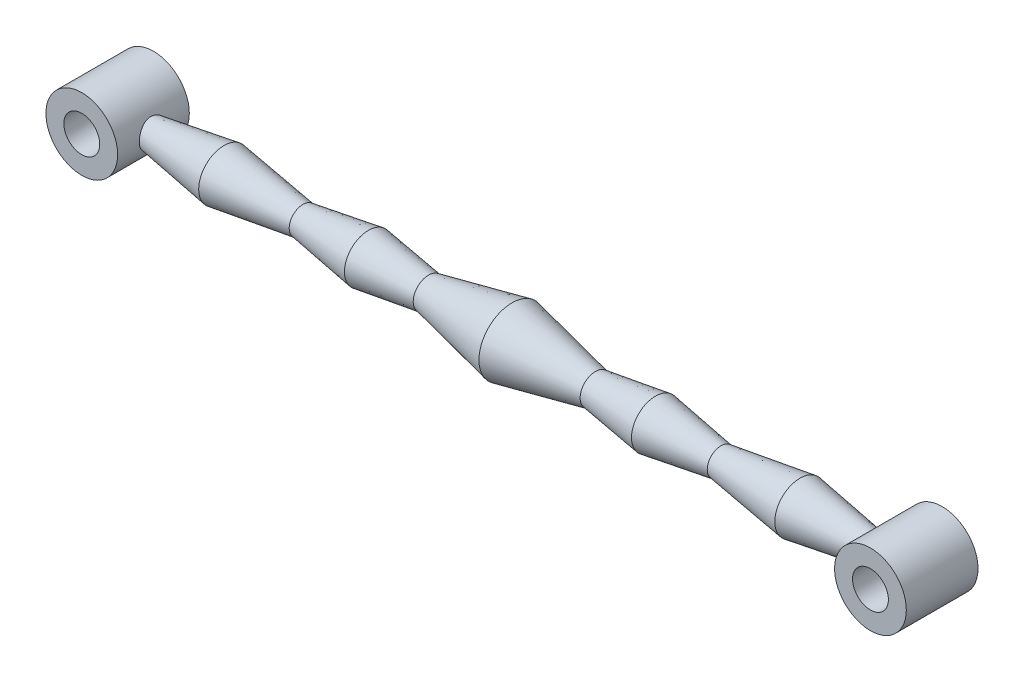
ISO-10303-21;
HEADER;
FILE_DESCRIPTION(('STEP AP214'),'2;1');
FILE_NAME('part.step','',(''),(''),'','','');
FILE_SCHEMA(('AUTOMOTIVE_DESIGN { 1 0 10303 214 1 1 1 1 }'));
ENDSEC;
DATA;
#1=APPLICATION_CONTEXT('core data for automotive mechanical design processes');
#2=APPLICATION_PROTOCOL_DEFINITION('international standard','automotive_design',2000,#1);
#3=PRODUCT_CONTEXT('',#1,'mechanical');
#4=PRODUCT('Part','Part','',(#3));
#5=PRODUCT_RELATED_PRODUCT_CATEGORY('part','',(#4));
#6=PRODUCT_DEFINITION_FORMATION('','',#4);
#7=PRODUCT_DEFINITION_CONTEXT('part definition',#1,'design');
#8=PRODUCT_DEFINITION('design','',#6,#7);
#9=PRODUCT_DEFINITION_SHAPE('','',#8);
#10=(LENGTH_UNIT() NAMED_UNIT(*) SI_UNIT(.MILLI.,.METRE.));
#11=(NAMED_UNIT(*) PLANE_ANGLE_UNIT() SI_UNIT($,.RADIAN.));
#12=(NAMED_UNIT(*) SI_UNIT($,.STERADIAN.) SOLID_ANGLE_UNIT());
#13=UNCERTAINTY_MEASURE_WITH_UNIT(LENGTH_MEASURE(1.E-05),#10,'distance_accuracy_value','');
#14=(GEOMETRIC_REPRESENTATION_CONTEXT(3) GLOBAL_UNCERTAINTY_ASSIGNED_CONTEXT((#13)) GLOBAL_UNIT_ASSIGNED_CONTEXT((#10,
#11,#12)) REPRESENTATION_CONTEXT('',''));
#15=CARTESIAN_POINT('',(0.,0.,0.));
#16=DIRECTION('',(0.,0.,1.));
#17=DIRECTION('',(1.,0.,0.));
#18=AXIS2_PLACEMENT_3D('',#15,#16,#17);
#19=CARTESIAN_POINT('',(-69.85,0.,6.35));
#20=DIRECTION('',(0.,0.,-1.));
#21=DIRECTION('',(-1.,0.,0.));
#22=AXIS2_PLACEMENT_3D('',#19,#20,#21);
#23=CYLINDRICAL_SURFACE('',#22,6.35);
#24=CARTESIAN_POINT('',(-69.85,0.,-6.35));
#25=DIRECTION('',(0.,0.,1.));
#26=DIRECTION('',(1.,0.,0.));
#27=AXIS2_PLACEMENT_3D('',#24,#25,#26);
#28=CIRCLE('',#27,6.35);
#29=CARTESIAN_POINT('',(-63.5,0.,-6.35));
#30=VERTEX_POINT('',#29);
#31=EDGE_CURVE('E54',#30,#30,#28,.T.);
#32=ORIENTED_EDGE('',*,*,#31,.T.);
#33=EDGE_LOOP('',(#32));
#34=FACE_BOUND('',#33,.T.);
#35=CARTESIAN_POINT('',(-69.85,0.,6.35));
#36=DIRECTION('',(0.,0.,1.));
#37=DIRECTION('',(1.,0.,0.));
#38=AXIS2_PLACEMENT_3D('',#35,#36,#37);
#39=CIRCLE('',#38,6.35);
#40=CARTESIAN_POINT('',(-63.5,0.,6.35));
#41=VERTEX_POINT('',#40);
#42=EDGE_CURVE('E50',#41,#41,#39,.T.);
#43=ORIENTED_EDGE('',*,*,#42,.F.);
#44=EDGE_LOOP('',(#43));
#45=FACE_BOUND('',#44,.T.);
#46=CARTESIAN_POINT('',(-63.8505130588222,-2.08054234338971,-1.30673742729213));
#47=CARTESIAN_POINT('',(-63.8255339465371,-2.00850741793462,-1.42879725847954));
#48=CARTESIAN_POINT('',(-63.7984993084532,-1.92638093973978,-1.54445966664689));
#49=CARTESIAN_POINT('',(-63.7434068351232,-1.74387161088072,-1.76007804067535));
#50=CARTESIAN_POINT('',(-63.7153490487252,-1.64348963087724,-1.86003475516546));
#51=CARTESIAN_POINT('',(-63.6612758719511,-1.42643327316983,-2.04162915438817));
#52=CARTESIAN_POINT('',(-63.6352648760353,-1.30972525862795,-2.12322808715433));
#53=CARTESIAN_POINT('',(-63.5883498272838,-1.06299680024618,-2.26498602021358));
#54=CARTESIAN_POINT('',(-63.5674435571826,-0.932982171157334,-2.32515433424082));
#55=CARTESIAN_POINT('',(-63.5341290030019,-0.670037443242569,-2.41909751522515));
#56=CARTESIAN_POINT('',(-63.5213515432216,-0.537569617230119,-2.45403063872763));
#57=CARTESIAN_POINT('',(-63.504228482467,-0.268084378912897,-2.50055972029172));
#58=CARTESIAN_POINT('',(-63.49987832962,-0.131069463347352,-2.51216827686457));
#59=CARTESIAN_POINT('',(-63.5001178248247,0.132601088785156,-2.51151940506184));
#60=CARTESIAN_POINT('',(-63.5040633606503,0.259265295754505,-2.50098154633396));
#61=CARTESIAN_POINT('',(-63.519186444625,0.508852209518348,-2.45993653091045));
#62=CARTESIAN_POINT('',(-63.5303638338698,0.63177499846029,-2.42942981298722));
#63=CARTESIAN_POINT('',(-63.5587488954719,0.870064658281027,-2.34985868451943));
#64=CARTESIAN_POINT('',(-63.575929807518,0.985462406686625,-2.3008765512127));
#65=CARTESIAN_POINT('',(-63.6146970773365,1.20670188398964,-2.18602532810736));
#66=CARTESIAN_POINT('',(-63.6362846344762,1.31254099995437,-2.12015163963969));
#67=CARTESIAN_POINT('',(-63.6834855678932,1.51941231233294,-1.9683842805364));
#68=CARTESIAN_POINT('',(-63.7092727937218,1.61962973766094,-1.8814347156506));
#69=CARTESIAN_POINT('',(-63.761142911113,1.80488015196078,-1.69268283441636));
#70=CARTESIAN_POINT('',(-63.7872259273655,1.88990646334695,-1.59087402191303));
#71=CARTESIAN_POINT('',(-63.8387903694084,2.0482337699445,-1.36746060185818));
#72=CARTESIAN_POINT('',(-63.8641136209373,2.12036308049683,-1.24498552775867));
#73=CARTESIAN_POINT('',(-63.9091704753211,2.2435168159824,-0.988889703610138));
#74=CARTESIAN_POINT('',(-63.9289047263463,2.29454368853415,-0.85527024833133));
#75=CARTESIAN_POINT('',(-63.9601559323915,2.37361565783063,-0.581479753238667));
#76=CARTESIAN_POINT('',(-63.9717300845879,2.40182092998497,-0.441361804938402));
#77=CARTESIAN_POINT('',(-63.9853043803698,2.4347853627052,-0.157960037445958));
#78=CARTESIAN_POINT('',(-63.9873080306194,2.439553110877,-0.0146773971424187));
#79=CARTESIAN_POINT('',(-63.981615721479,2.42581963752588,0.2636177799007));
#80=CARTESIAN_POINT('',(-63.9743819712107,2.40842732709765,0.398696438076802));
#81=CARTESIAN_POINT('',(-63.9519190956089,2.35287642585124,0.663816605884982));
#82=CARTESIAN_POINT('',(-63.9366889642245,2.31471522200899,0.793857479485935));
#83=CARTESIAN_POINT('',(-63.8998934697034,2.21842094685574,1.04654922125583));
#84=CARTESIAN_POINT('',(-63.8782782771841,2.16013015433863,1.16913245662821));
#85=CARTESIAN_POINT('',(-63.8311637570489,2.02514398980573,1.4029073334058));
#86=CARTESIAN_POINT('',(-63.8056631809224,1.94844269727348,1.51409529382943));
#87=CARTESIAN_POINT('',(-63.7521414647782,1.77407121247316,1.72766927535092));
#88=CARTESIAN_POINT('',(-63.7240580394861,1.67555180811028,1.82934836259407));
#89=CARTESIAN_POINT('',(-63.6696651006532,1.46221010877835,2.01450931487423));
#90=CARTESIAN_POINT('',(-63.6433556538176,1.34738720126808,2.09799049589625));
#91=CARTESIAN_POINT('',(-63.5956835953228,1.10505206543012,2.24339734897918));
#92=CARTESIAN_POINT('',(-63.5742849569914,0.977642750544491,2.30548179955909));
#93=CARTESIAN_POINT('',(-63.5387452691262,0.712976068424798,2.40635044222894));
#94=CARTESIAN_POINT('',(-63.5245993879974,0.575725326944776,2.44515014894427));
#95=CARTESIAN_POINT('',(-63.5060848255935,0.306629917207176,2.49555584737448));
#96=CARTESIAN_POINT('',(-63.5010493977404,0.175178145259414,2.50901949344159));
#97=CARTESIAN_POINT('',(-63.4992486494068,-0.0881705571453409,2.51385737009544));
#98=CARTESIAN_POINT('',(-63.5024808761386,-0.220067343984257,2.50523815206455));
#99=CARTESIAN_POINT('',(-63.5164732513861,-0.473557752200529,2.46732690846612));
#100=CARTESIAN_POINT('',(-63.5268448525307,-0.595335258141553,2.43910123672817));
#101=CARTESIAN_POINT('',(-63.5536606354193,-0.832375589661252,2.36426093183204));
#102=CARTESIAN_POINT('',(-63.5701055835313,-0.947637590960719,2.31764397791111));
#103=CARTESIAN_POINT('',(-63.6081545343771,-1.17275044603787,2.20576379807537));
#104=CARTESIAN_POINT('',(-63.6299137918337,-1.28228781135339,2.13992486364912));
#105=CARTESIAN_POINT('',(-63.6762190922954,-1.48936475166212,1.99229414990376));
#106=CARTESIAN_POINT('',(-63.7007662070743,-1.58689968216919,1.91049622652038));
#107=CARTESIAN_POINT('',(-63.7523792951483,-1.77533331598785,1.7259706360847));
#108=CARTESIAN_POINT('',(-63.7794913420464,-1.86510363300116,1.62210169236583));
#109=CARTESIAN_POINT('',(-63.8315184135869,-2.02672304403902,1.40072605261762));
#110=CARTESIAN_POINT('',(-63.8564327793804,-2.09856677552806,1.28321529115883));
#111=CARTESIAN_POINT('',(-63.902190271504,-2.22503412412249,1.03253444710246));
#112=CARTESIAN_POINT('',(-63.9228370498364,-2.27887811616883,0.898932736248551));
#113=CARTESIAN_POINT('',(-63.9561213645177,-2.36364014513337,0.623717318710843));
#114=CARTESIAN_POINT('',(-63.9687623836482,-2.39456815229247,0.482107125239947));
#115=CARTESIAN_POINT('',(-63.9840004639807,-2.43165392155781,0.200598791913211));
#116=CARTESIAN_POINT('',(-63.9869586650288,-2.43870267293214,0.0608378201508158));
#117=CARTESIAN_POINT('',(-63.9834562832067,-2.43026379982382,-0.217886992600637));
#118=CARTESIAN_POINT('',(-63.9769949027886,-2.41477426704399,-0.356850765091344));
#119=CARTESIAN_POINT('',(-63.9549262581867,-2.36040342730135,-0.637172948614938));
#120=CARTESIAN_POINT('',(-63.9388461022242,-2.32030964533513,-0.778258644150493));
#121=CARTESIAN_POINT('',(-63.8993988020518,-2.21717490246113,-1.05070338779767));
#122=CARTESIAN_POINT('',(-63.8760282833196,-2.15412331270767,-1.18205789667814));
#123=CARTESIAN_POINT('',(-63.8505130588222,-2.08054234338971,-1.30673742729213));
#124=B_SPLINE_CURVE_WITH_KNOTS('',3,(#46,#47,#48,#49,#50,#51,#52,#53,#54,#55,#56,#57,#58,#59,
#60,#61,#62,#63,#64,#65,#66,#67,#68,#69,#70,#71,#72,#73,#74,#75,#76,#77,#78,#79,#80,#81,#82,#83,
#84,#85,#86,#87,#88,#89,#90,#91,#92,#93,#94,#95,#96,#97,#98,#99,#100,#101,#102,#103,#104,#105,
#106,#107,#108,#109,#110,#111,#112,#113,#114,#115,#116,#117,#118,#119,#120,#121,#122,#123),
.UNSPECIFIED.,.T.,.F.,(4,2,2,2,2,2,2,2,2,2,2,2,2,2,2,2,2,2,2,2,2,2,2,2,2,2,2,2,2,2,2,2,2,2,2,2,
2,2,4),(0.,0.431223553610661,0.862426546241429,1.29453141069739,1.72644825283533,
2.13700194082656,2.54733381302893,2.92698501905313,3.30662788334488,3.68459965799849,
4.06267444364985,4.46642877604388,4.87036015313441,5.30143184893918,5.7324535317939,
6.16042315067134,6.58823594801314,6.99545773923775,7.40273077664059,7.81327017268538,
8.22394176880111,8.65491671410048,9.08590785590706,9.51362817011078,9.94106317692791,
10.3357108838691,10.730241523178,11.1048411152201,11.4794879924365,11.8667670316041,
12.2541954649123,12.6721499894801,13.0902293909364,13.5245912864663,13.9587640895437,
14.3765471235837,14.7943655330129,15.2346400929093,15.6751187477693),.UNSPECIFIED.);
#125=CARTESIAN_POINT('',(-63.8505130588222,-2.08054234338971,-1.30673742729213));
#126=VERTEX_POINT('',#125);
#127=EDGE_CURVE('E46',#126,#126,#124,.T.);
#128=ORIENTED_EDGE('',*,*,#127,.F.);
#129=EDGE_LOOP('',(#128));
#130=FACE_BOUND('',#129,.T.);
#131=ADVANCED_FACE('F35',(#34,#45,#130),#23,.T.);
#132=CARTESIAN_POINT('',(0.,-119.091685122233,6.35));
#133=DIRECTION('',(0.,0.,1.));
#134=DIRECTION('',(1.,0.,0.));
#135=AXIS2_PLACEMENT_3D('',#132,#133,#134);
#136=PLANE('',#135);
#137=CARTESIAN_POINT('',(-69.85,0.,6.35));
#138=DIRECTION('',(0.,0.,1.));
#139=DIRECTION('',(1.,0.,0.));
#140=AXIS2_PLACEMENT_3D('',#137,#138,#139);
#141=CIRCLE('',#140,3.175);
#142=CARTESIAN_POINT('',(-66.675,0.,6.35));
#143=VERTEX_POINT('',#142);
#144=EDGE_CURVE('E129',#143,#143,#141,.T.);
#145=ORIENTED_EDGE('',*,*,#144,.F.);
#146=EDGE_LOOP('',(#145));
#147=FACE_BOUND('',#146,.T.);
#148=ORIENTED_EDGE('',*,*,#42,.T.);
#149=EDGE_LOOP('',(#148));
#150=FACE_BOUND('',#149,.T.);
#151=ADVANCED_FACE('F109',(#147,#150),#136,.T.);
#152=CARTESIAN_POINT('',(0.,-119.091685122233,-6.35));
#153=DIRECTION('',(0.,0.,1.));
#154=DIRECTION('',(1.,0.,0.));
#155=AXIS2_PLACEMENT_3D('',#152,#153,#154);
#156=PLANE('',#155);
#157=CARTESIAN_POINT('',(-69.85,0.,-6.35));
#158=DIRECTION('',(0.,0.,1.));
#159=DIRECTION('',(1.,0.,0.));
#160=AXIS2_PLACEMENT_3D('',#157,#158,#159);
#161=CIRCLE('',#160,3.175);
#162=CARTESIAN_POINT('',(-66.675,0.,-6.35));
#163=VERTEX_POINT('',#162);
#164=EDGE_CURVE('E128',#163,#163,#161,.T.);
#165=ORIENTED_EDGE('',*,*,#164,.T.);
#166=EDGE_LOOP('',(#165));
#167=FACE_BOUND('',#166,.T.);
#168=ORIENTED_EDGE('',*,*,#31,.F.);
#169=EDGE_LOOP('',(#168));
#170=FACE_BOUND('',#169,.T.);
#171=ADVANCED_FACE('F107',(#167,#170),#156,.F.);
#172=CARTESIAN_POINT('',(-69.85,0.,-6.35));
#173=DIRECTION('',(0.,0.,1.));
#174=DIRECTION('',(1.,0.,0.));
#175=AXIS2_PLACEMENT_3D('',#172,#173,#174);
#176=CYLINDRICAL_SURFACE('',#175,3.175);
#177=ORIENTED_EDGE('',*,*,#164,.F.);
#178=EDGE_LOOP('',(#177));
#179=FACE_BOUND('',#178,.T.);
#180=ORIENTED_EDGE('',*,*,#144,.T.);
#181=EDGE_LOOP('',(#180));
#182=FACE_BOUND('',#181,.T.);
#183=ADVANCED_FACE('F65',(#179,#182),#176,.F.);
#184=CARTESIAN_POINT('',(-51.0228405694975,0.,0.));
#185=DIRECTION('',(1.,0.,0.));
#186=DIRECTION('',(0.,0.,-1.));
#187=AXIS2_PLACEMENT_3D('',#184,#185,#186);
#188=CONICAL_SURFACE('',#187,4.46848127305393,0.155551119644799);
#189=CARTESIAN_POINT('',(-51.0228405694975,0.,0.));
#190=DIRECTION('',(-1.,0.,0.));
#191=DIRECTION('',(0.,0.,1.));
#192=AXIS2_PLACEMENT_3D('',#189,#190,#191);
#193=CIRCLE('',#192,4.46848127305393);
#194=CARTESIAN_POINT('',(-51.0228405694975,0.,4.46848127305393));
#195=VERTEX_POINT('',#194);
#196=EDGE_CURVE('E159',#195,#195,#193,.T.);
#197=ORIENTED_EDGE('',*,*,#196,.T.);
#198=EDGE_LOOP('',(#197));
#199=FACE_BOUND('',#198,.T.);
#200=ORIENTED_EDGE('',*,*,#127,.T.);
#201=EDGE_LOOP('',(#200));
#202=FACE_BOUND('',#201,.T.);
#203=ADVANCED_FACE('F60',(#199,#202),#188,.T.);
#204=CARTESIAN_POINT('',(63.985701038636,0.,0.));
#205=DIRECTION('',(-1.,0.,0.));
#206=DIRECTION('',(0.,0.,1.));
#207=AXIS2_PLACEMENT_3D('',#204,#205,#206);
#208=CONICAL_SURFACE('',#207,2.43567191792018,0.155551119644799);
#209=CARTESIAN_POINT('',(51.0228405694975,0.,0.));
#210=DIRECTION('',(-1.,0.,0.));
#211=DIRECTION('',(0.,0.,1.));
#212=AXIS2_PLACEMENT_3D('',#209,#210,#211);
#213=CIRCLE('',#212,4.46848127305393);
#214=CARTESIAN_POINT('',(51.0228405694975,0.,4.46848127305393));
#215=VERTEX_POINT('',#214);
#216=EDGE_CURVE('E133',#215,#215,#213,.T.);
#217=ORIENTED_EDGE('',*,*,#216,.F.);
#218=EDGE_LOOP('',(#217));
#219=FACE_BOUND('',#218,.T.);
#220=CARTESIAN_POINT('',(63.8505130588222,-2.08054234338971,-1.30673742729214));
#221=CARTESIAN_POINT('',(63.8747198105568,-2.1503478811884,-1.18844377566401));
#222=CARTESIAN_POINT('',(63.8970303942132,-2.21076835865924,-1.06396940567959));
#223=CARTESIAN_POINT('',(63.935237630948,-2.31106068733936,-0.805817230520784));
#224=CARTESIAN_POINT('',(63.9511195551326,-2.35088540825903,-0.672119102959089));
#225=CARTESIAN_POINT('',(63.9744361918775,-2.40857491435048,-0.39915359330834));
#226=CARTESIAN_POINT('',(63.981862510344,-2.42641787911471,-0.259880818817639));
#227=CARTESIAN_POINT('',(63.9872328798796,-2.43936849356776,0.0198014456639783));
#228=CARTESIAN_POINT('',(63.9851840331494,-2.43449317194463,0.160210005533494));
#229=CARTESIAN_POINT('',(63.9721311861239,-2.40279489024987,0.433240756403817));
#230=CARTESIAN_POINT('',(63.9614323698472,-2.37671971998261,0.565965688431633));
#231=CARTESIAN_POINT('',(63.9327756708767,-2.30444212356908,0.82500532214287));
#232=CARTESIAN_POINT('',(63.9148155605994,-2.25823352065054,0.951318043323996));
#233=CARTESIAN_POINT('',(63.8732075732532,-2.14572018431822,1.19721417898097));
#234=CARTESIAN_POINT('',(63.8494387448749,-2.07897903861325,1.31657694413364));
#235=CARTESIAN_POINT('',(63.7990546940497,-1.92741455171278,1.54256879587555));
#236=CARTESIAN_POINT('',(63.7724385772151,-1.84258552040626,1.64919385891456));
#237=CARTESIAN_POINT('',(63.7179304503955,-1.65240076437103,1.85162392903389));
#238=CARTESIAN_POINT('',(63.6900351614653,-1.54629038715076,1.94672178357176));
#239=CARTESIAN_POINT('',(63.6373234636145,-1.31862591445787,2.1173197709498));
#240=CARTESIAN_POINT('',(63.6125066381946,-1.19707391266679,2.19282255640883));
#241=CARTESIAN_POINT('',(63.5694309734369,-0.944917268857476,2.31975673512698));
#242=CARTESIAN_POINT('',(63.551018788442,-0.814629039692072,2.37176146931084));
#243=CARTESIAN_POINT('',(63.5220941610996,-0.546151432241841,2.45219362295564));
#244=CARTESIAN_POINT('',(63.5115764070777,-0.407967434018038,2.48063689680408));
#245=CARTESIAN_POINT('',(63.5002283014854,-0.13959261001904,2.51126040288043));
#246=CARTESIAN_POINT('',(63.4986891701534,-0.00964865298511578,2.51536262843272));
#247=CARTESIAN_POINT('',(63.5035663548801,0.248992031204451,2.50225562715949));
#248=CARTESIAN_POINT('',(63.509981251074,0.377688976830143,2.48505020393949));
#249=CARTESIAN_POINT('',(63.5297130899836,0.625644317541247,2.43106300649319));
#250=CARTESIAN_POINT('',(63.5427851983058,0.745075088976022,2.39497448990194));
#251=CARTESIAN_POINT('',(63.5744078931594,0.976252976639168,2.30503074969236));
#252=CARTESIAN_POINT('',(63.5929594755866,1.08799869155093,2.25117229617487));
#253=CARTESIAN_POINT('',(63.63484155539,1.30663736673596,2.12437772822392));
#254=CARTESIAN_POINT('',(63.6583610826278,1.4130274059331,2.05063889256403));
#255=CARTESIAN_POINT('',(63.7073238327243,1.61264134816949,1.88760612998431));
#256=CARTESIAN_POINT('',(63.7327678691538,1.70585963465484,1.79830560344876));
#257=CARTESIAN_POINT('',(63.7851802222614,1.88407919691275,1.59879394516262));
#258=CARTESIAN_POINT('',(63.8121132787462,1.96787844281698,1.48749695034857));
#259=CARTESIAN_POINT('',(63.862517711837,2.11629836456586,1.25204165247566));
#260=CARTESIAN_POINT('',(63.885988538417,2.18091599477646,1.12788131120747));
#261=CARTESIAN_POINT('',(63.927177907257,2.29045858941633,0.866907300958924));
#262=CARTESIAN_POINT('',(63.9447581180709,2.33491764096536,0.729874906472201));
#263=CARTESIAN_POINT('',(63.9710968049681,2.40047302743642,0.449535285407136));
#264=CARTESIAN_POINT('',(63.9798591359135,2.42157957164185,0.306230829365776));
#265=CARTESIAN_POINT('',(63.9871684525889,2.43921862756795,0.0244634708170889));
#266=CARTESIAN_POINT('',(63.9861645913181,2.43683156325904,-0.113920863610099));
#267=CARTESIAN_POINT('',(63.9751511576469,2.41015637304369,-0.38818609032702));
#268=CARTESIAN_POINT('',(63.9651417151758,2.38586856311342,-0.524067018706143));
#269=CARTESIAN_POINT('',(63.9376442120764,2.31686907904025,-0.787117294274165));
#270=CARTESIAN_POINT('',(63.9202910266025,2.27252479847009,-0.91439795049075));
#271=CARTESIAN_POINT('',(63.8801286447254,2.16481539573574,-1.15971716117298));
#272=CARTESIAN_POINT('',(63.8573179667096,2.10144510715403,-1.27775319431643));
#273=CARTESIAN_POINT('',(63.8075572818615,1.95389494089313,-1.50700456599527));
#274=CARTESIAN_POINT('',(63.7804660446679,1.86889858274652,-1.61766422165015));
#275=CARTESIAN_POINT('',(63.7259370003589,1.68162156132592,-1.82320101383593));
#276=CARTESIAN_POINT('',(63.698499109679,1.5793366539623,-1.91807426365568));
#277=CARTESIAN_POINT('',(63.6457033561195,1.35737442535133,-2.09112193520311));
#278=CARTESIAN_POINT('',(63.620400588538,1.23737975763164,-2.16890823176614));
#279=CARTESIAN_POINT('',(63.5755010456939,0.98467427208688,-2.30234303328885));
#280=CARTESIAN_POINT('',(63.5559013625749,0.851969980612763,-2.35800282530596));
#281=CARTESIAN_POINT('',(63.5257838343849,0.586154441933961,-2.44206659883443));
#282=CARTESIAN_POINT('',(63.5147867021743,0.453557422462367,-2.4719206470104));
#283=CARTESIAN_POINT('',(63.5012669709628,0.184804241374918,-2.50849483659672));
#284=CARTESIAN_POINT('',(63.498740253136,0.0486498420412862,-2.51522622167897));
#285=CARTESIAN_POINT('',(63.5023198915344,-0.213009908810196,-2.50560412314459));
#286=CARTESIAN_POINT('',(63.5078271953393,-0.33858620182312,-2.49085263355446));
#287=CARTESIAN_POINT('',(63.5258223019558,-0.585299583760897,-2.44177105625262));
#288=CARTESIAN_POINT('',(63.5383093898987,-0.706437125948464,-2.40744297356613));
#289=CARTESIAN_POINT('',(63.5690875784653,-0.941697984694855,-2.32035263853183));
#290=CARTESIAN_POINT('',(63.5874048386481,-1.05578686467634,-2.26750719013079));
#291=CARTESIAN_POINT('',(63.6281070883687,-1.2739250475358,-2.14512861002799));
#292=CARTESIAN_POINT('',(63.6504957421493,-1.37796517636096,-2.07558042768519));
#293=CARTESIAN_POINT('',(63.6990392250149,-1.58110037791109,-1.916113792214));
#294=CARTESIAN_POINT('',(63.7253497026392,-1.67927894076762,-1.82507837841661));
#295=CARTESIAN_POINT('',(63.7776681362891,-1.85959463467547,-1.62852417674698));
#296=CARTESIAN_POINT('',(63.8036766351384,-1.94176696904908,-1.52303806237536));
#297=CARTESIAN_POINT('',(63.8358017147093,-2.03776559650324,-1.3772355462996));
#298=CARTESIAN_POINT('',(63.8432429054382,-2.05957724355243,-1.34226524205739));
#299=CARTESIAN_POINT('',(63.8505130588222,-2.08054234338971,-1.30673742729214));
#300=B_SPLINE_CURVE_WITH_KNOTS('',3,(#220,#221,#222,#223,#224,#225,#226,#227,#228,#229,#230,
#231,#232,#233,#234,#235,#236,#237,#238,#239,#240,#241,#242,#243,#244,#245,#246,#247,#248,#249,
#250,#251,#252,#253,#254,#255,#256,#257,#258,#259,#260,#261,#262,#263,#264,#265,#266,#267,#268,
#269,#270,#271,#272,#273,#274,#275,#276,#277,#278,#279,#280,#281,#282,#283,#284,#285,#286,#287,
#288,#289,#290,#291,#292,#293,#294,#295,#296,#297,#298,#299),.UNSPECIFIED.,.T.,.F.,(4,2,2,2,2,2,
2,2,2,2,2,2,2,2,2,2,2,2,2,2,2,2,2,2,2,2,2,2,2,2,2,2,2,2,2,2,2,2,2,4),(0.,0.418300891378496,
0.837554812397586,1.25722457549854,1.67657982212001,2.08175352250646,2.48705161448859,
2.90164102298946,3.31636104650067,3.74983141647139,4.18324307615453,4.60541776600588,
5.02730814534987,5.41538924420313,5.80340107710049,6.17807519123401,6.55281744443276,
6.94584690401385,7.33904345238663,7.76280491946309,8.18663363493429,8.61981289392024,
9.05280270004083,9.46597673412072,9.87914480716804,10.2850331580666,10.691031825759,
11.115526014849,11.5401245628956,11.9735494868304,12.4067530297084,12.8136459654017,
13.2203410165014,13.5982176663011,13.9760556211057,14.3556133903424,14.7355144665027,
15.1431688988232,15.5499163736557,15.6755470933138),.UNSPECIFIED.);
#301=CARTESIAN_POINT('',(63.8505130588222,-2.08054234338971,-1.30673742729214));
#302=VERTEX_POINT('',#301);
#303=EDGE_CURVE('E10',#302,#302,#300,.T.);
#304=ORIENTED_EDGE('',*,*,#303,.T.);
#305=EDGE_LOOP('',(#304));
#306=FACE_BOUND('',#305,.T.);
#307=ADVANCED_FACE('F64',(#219,#306),#208,.T.);
#308=CARTESIAN_POINT('',(51.0228405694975,0.,0.));
#309=DIRECTION('',(1.,0.,0.));
#310=DIRECTION('',(0.,0.,-1.));
#311=AXIS2_PLACEMENT_3D('',#308,#309,#310);
#312=CONICAL_SURFACE('',#311,4.46848127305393,0.144208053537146);
#313=CARTESIAN_POINT('',(37.024327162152,0.,0.));
#314=DIRECTION('',(-1.,0.,0.));
#315=DIRECTION('',(0.,0.,1.));
#316=AXIS2_PLACEMENT_3D('',#313,#314,#315);
#317=CIRCLE('',#316,2.43567191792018);
#318=CARTESIAN_POINT('',(37.024327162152,0.,2.43567191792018));
#319=VERTEX_POINT('',#318);
#320=EDGE_CURVE('E138',#319,#319,#317,.T.);
#321=ORIENTED_EDGE('',*,*,#320,.F.);
#322=EDGE_LOOP('',(#321));
#323=FACE_BOUND('',#322,.T.);
#324=ORIENTED_EDGE('',*,*,#216,.T.);
#325=EDGE_LOOP('',(#324));
#326=FACE_BOUND('',#325,.T.);
#327=ADVANCED_FACE('F97',(#323,#326),#312,.T.);
#328=CARTESIAN_POINT('',(37.024327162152,0.,0.));
#329=DIRECTION('',(-1.,0.,0.));
#330=DIRECTION('',(0.,0.,1.));
#331=AXIS2_PLACEMENT_3D('',#328,#329,#330);
#332=CONICAL_SURFACE('',#331,2.43567191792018,0.155551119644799);
#333=CARTESIAN_POINT('',(25.4258689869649,0.,0.));
#334=DIRECTION('',(-1.,0.,0.));
#335=DIRECTION('',(0.,0.,1.));
#336=AXIS2_PLACEMENT_3D('',#333,#334,#335);
#337=CIRCLE('',#336,4.25451848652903);
#338=CARTESIAN_POINT('',(25.4258689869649,0.,4.25451848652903));
#339=VERTEX_POINT('',#338);
#340=EDGE_CURVE('E141',#339,#339,#337,.T.);
#341=ORIENTED_EDGE('',*,*,#340,.F.);
#342=EDGE_LOOP('',(#341));
#343=FACE_BOUND('',#342,.T.);
#344=ORIENTED_EDGE('',*,*,#320,.T.);
#345=EDGE_LOOP('',(#344));
#346=FACE_BOUND('',#345,.T.);
#347=ADVANCED_FACE('F93',(#343,#346),#332,.T.);
#348=CARTESIAN_POINT('',(25.4258689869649,0.,0.));
#349=DIRECTION('',(1.,0.,0.));
#350=DIRECTION('',(0.,0.,-1.));
#351=AXIS2_PLACEMENT_3D('',#348,#349,#350);
#352=CONICAL_SURFACE('',#351,4.25451848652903,0.144208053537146);
#353=CARTESIAN_POINT('',(14.7841227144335,0.,0.));
#354=DIRECTION('',(-1.,0.,0.));
#355=DIRECTION('',(0.,0.,1.));
#356=AXIS2_PLACEMENT_3D('',#353,#354,#355);
#357=CIRCLE('',#356,2.70916572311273);
#358=CARTESIAN_POINT('',(14.7841227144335,0.,2.70916572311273));
#359=VERTEX_POINT('',#358);
#360=EDGE_CURVE('E144',#359,#359,#357,.T.);
#361=ORIENTED_EDGE('',*,*,#360,.F.);
#362=EDGE_LOOP('',(#361));
#363=FACE_BOUND('',#362,.T.);
#364=ORIENTED_EDGE('',*,*,#340,.T.);
#365=EDGE_LOOP('',(#364));
#366=FACE_BOUND('',#365,.T.);
#367=ADVANCED_FACE('F89',(#363,#366),#352,.T.);
#368=CARTESIAN_POINT('',(14.7841227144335,0.,0.));
#369=DIRECTION('',(-1.,0.,0.));
#370=DIRECTION('',(0.,0.,1.));
#371=AXIS2_PLACEMENT_3D('',#368,#369,#370);
#372=CONICAL_SURFACE('',#371,2.70916572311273,0.209244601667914);
#373=CARTESIAN_POINT('',(0.,0.,0.));
#374=DIRECTION('',(-1.,0.,0.));
#375=DIRECTION('',(0.,0.,1.));
#376=AXIS2_PLACEMENT_3D('',#373,#374,#375);
#377=CIRCLE('',#376,5.8486163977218);
#378=CARTESIAN_POINT('',(0.,0.,5.8486163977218));
#379=VERTEX_POINT('',#378);
#380=EDGE_CURVE('E147',#379,#379,#377,.T.);
#381=ORIENTED_EDGE('',*,*,#380,.F.);
#382=EDGE_LOOP('',(#381));
#383=FACE_BOUND('',#382,.T.);
#384=ORIENTED_EDGE('',*,*,#360,.T.);
#385=EDGE_LOOP('',(#384));
#386=FACE_BOUND('',#385,.T.);
#387=ADVANCED_FACE('F85',(#383,#386),#372,.T.);
#388=CARTESIAN_POINT('',(0.,0.,0.));
#389=DIRECTION('',(1.,0.,0.));
#390=DIRECTION('',(0.,0.,-1.));
#391=AXIS2_PLACEMENT_3D('',#388,#389,#390);
#392=CONICAL_SURFACE('',#391,5.8486163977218,0.209244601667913);
#393=CARTESIAN_POINT('',(-14.7841227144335,0.,0.));
#394=DIRECTION('',(-1.,0.,0.));
#395=DIRECTION('',(0.,0.,1.));
#396=AXIS2_PLACEMENT_3D('',#393,#394,#395);
#397=CIRCLE('',#396,2.70916572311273);
#398=CARTESIAN_POINT('',(-14.7841227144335,0.,2.70916572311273));
#399=VERTEX_POINT('',#398);
#400=EDGE_CURVE('E150',#399,#399,#397,.T.);
#401=ORIENTED_EDGE('',*,*,#400,.F.);
#402=EDGE_LOOP('',(#401));
#403=FACE_BOUND('',#402,.T.);
#404=ORIENTED_EDGE('',*,*,#380,.T.);
#405=EDGE_LOOP('',(#404));
#406=FACE_BOUND('',#405,.T.);
#407=ADVANCED_FACE('F81',(#403,#406),#392,.T.);
#408=CARTESIAN_POINT('',(-14.7841227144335,0.,0.));
#409=DIRECTION('',(-1.,0.,0.));
#410=DIRECTION('',(0.,0.,1.));
#411=AXIS2_PLACEMENT_3D('',#408,#409,#410);
#412=CONICAL_SURFACE('',#411,2.70916572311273,0.144208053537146);
#413=CARTESIAN_POINT('',(-25.4258689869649,0.,0.));
#414=DIRECTION('',(-1.,0.,0.));
#415=DIRECTION('',(0.,0.,1.));
#416=AXIS2_PLACEMENT_3D('',#413,#414,#415);
#417=CIRCLE('',#416,4.25451848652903);
#418=CARTESIAN_POINT('',(-25.4258689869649,0.,4.25451848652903));
#419=VERTEX_POINT('',#418);
#420=EDGE_CURVE('E153',#419,#419,#417,.T.);
#421=ORIENTED_EDGE('',*,*,#420,.F.);
#422=EDGE_LOOP('',(#421));
#423=FACE_BOUND('',#422,.T.);
#424=ORIENTED_EDGE('',*,*,#400,.T.);
#425=EDGE_LOOP('',(#424));
#426=FACE_BOUND('',#425,.T.);
#427=ADVANCED_FACE('F77',(#423,#426),#412,.T.);
#428=CARTESIAN_POINT('',(-25.4258689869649,0.,0.));
#429=DIRECTION('',(1.,0.,0.));
#430=DIRECTION('',(0.,0.,-1.));
#431=AXIS2_PLACEMENT_3D('',#428,#429,#430);
#432=CONICAL_SURFACE('',#431,4.25451848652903,0.155551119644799);
#433=CARTESIAN_POINT('',(-37.024327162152,0.,0.));
#434=DIRECTION('',(-1.,0.,0.));
#435=DIRECTION('',(0.,0.,1.));
#436=AXIS2_PLACEMENT_3D('',#433,#434,#435);
#437=CIRCLE('',#436,2.43567191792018);
#438=CARTESIAN_POINT('',(-37.024327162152,0.,2.43567191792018));
#439=VERTEX_POINT('',#438);
#440=EDGE_CURVE('E156',#439,#439,#437,.T.);
#441=ORIENTED_EDGE('',*,*,#440,.F.);
#442=EDGE_LOOP('',(#441));
#443=FACE_BOUND('',#442,.T.);
#444=ORIENTED_EDGE('',*,*,#420,.T.);
#445=EDGE_LOOP('',(#444));
#446=FACE_BOUND('',#445,.T.);
#447=ADVANCED_FACE('F73',(#443,#446),#432,.T.);
#448=CARTESIAN_POINT('',(-37.024327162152,0.,0.));
#449=DIRECTION('',(-1.,0.,0.));
#450=DIRECTION('',(0.,0.,1.));
#451=AXIS2_PLACEMENT_3D('',#448,#449,#450);
#452=CONICAL_SURFACE('',#451,2.43567191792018,0.144208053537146);
#453=ORIENTED_EDGE('',*,*,#196,.F.);
#454=EDGE_LOOP('',(#453));
#455=FACE_BOUND('',#454,.T.);
#456=ORIENTED_EDGE('',*,*,#440,.T.);
#457=EDGE_LOOP('',(#456));
#458=FACE_BOUND('',#457,.T.);
#459=ADVANCED_FACE('F70',(#455,#458),#452,.T.);
#460=CARTESIAN_POINT('',(69.85,0.,6.35));
#461=DIRECTION('',(0.,0.,-1.));
#462=DIRECTION('',(-1.,0.,0.));
#463=AXIS2_PLACEMENT_3D('',#460,#461,#462);
#464=CYLINDRICAL_SURFACE('',#463,6.35);
#465=CARTESIAN_POINT('',(69.85,0.,-6.35));
#466=DIRECTION('',(0.,0.,1.));
#467=DIRECTION('',(1.,0.,0.));
#468=AXIS2_PLACEMENT_3D('',#465,#466,#467);
#469=CIRCLE('',#468,6.35);
#470=CARTESIAN_POINT('',(76.2,0.,-6.35));
#471=VERTEX_POINT('',#470);
#472=EDGE_CURVE('E163',#471,#471,#469,.F.);
#473=ORIENTED_EDGE('',*,*,#472,.F.);
#474=EDGE_LOOP('',(#473));
#475=FACE_BOUND('',#474,.T.);
#476=CARTESIAN_POINT('',(69.85,0.,6.35));
#477=DIRECTION('',(0.,0.,1.));
#478=DIRECTION('',(1.,0.,0.));
#479=AXIS2_PLACEMENT_3D('',#476,#477,#478);
#480=CIRCLE('',#479,6.35);
#481=CARTESIAN_POINT('',(76.2,0.,6.35));
#482=VERTEX_POINT('',#481);
#483=EDGE_CURVE('E162',#482,#482,#480,.F.);
#484=ORIENTED_EDGE('',*,*,#483,.T.);
#485=EDGE_LOOP('',(#484));
#486=FACE_BOUND('',#485,.T.);
#487=ORIENTED_EDGE('',*,*,#303,.F.);
#488=EDGE_LOOP('',(#487));
#489=FACE_BOUND('',#488,.T.);
#490=ADVANCED_FACE('F67',(#475,#486,#489),#464,.T.);
#491=CARTESIAN_POINT('',(0.,-119.091685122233,6.35));
#492=DIRECTION('',(0.,0.,1.));
#493=DIRECTION('',(1.,0.,0.));
#494=AXIS2_PLACEMENT_3D('',#491,#492,#493);
#495=PLANE('',#494);
#496=ORIENTED_EDGE('',*,*,#483,.F.);
#497=EDGE_LOOP('',(#496));
#498=FACE_BOUND('',#497,.T.);
#499=CARTESIAN_POINT('',(69.85,0.,6.35));
#500=DIRECTION('',(0.,0.,1.));
#501=DIRECTION('',(1.,0.,0.));
#502=AXIS2_PLACEMENT_3D('',#499,#500,#501);
#503=CIRCLE('',#502,3.175);
#504=CARTESIAN_POINT('',(73.025,0.,6.35));
#505=VERTEX_POINT('',#504);
#506=EDGE_CURVE('E169',#505,#505,#503,.F.);
#507=ORIENTED_EDGE('',*,*,#506,.T.);
#508=EDGE_LOOP('',(#507));
#509=FACE_BOUND('',#508,.T.);
#510=ADVANCED_FACE('F180',(#498,#509),#495,.T.);
#511=CARTESIAN_POINT('',(0.,-119.091685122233,-6.35));
#512=DIRECTION('',(0.,0.,1.));
#513=DIRECTION('',(1.,0.,0.));
#514=AXIS2_PLACEMENT_3D('',#511,#512,#513);
#515=PLANE('',#514);
#516=ORIENTED_EDGE('',*,*,#472,.T.);
#517=EDGE_LOOP('',(#516));
#518=FACE_BOUND('',#517,.T.);
#519=CARTESIAN_POINT('',(69.85,0.,-6.35));
#520=DIRECTION('',(0.,0.,1.));
#521=DIRECTION('',(1.,0.,0.));
#522=AXIS2_PLACEMENT_3D('',#519,#520,#521);
#523=CIRCLE('',#522,3.175);
#524=CARTESIAN_POINT('',(73.025,0.,-6.35));
#525=VERTEX_POINT('',#524);
#526=EDGE_CURVE('E166',#525,#525,#523,.F.);
#527=ORIENTED_EDGE('',*,*,#526,.F.);
#528=EDGE_LOOP('',(#527));
#529=FACE_BOUND('',#528,.T.);
#530=ADVANCED_FACE('F178',(#518,#529),#515,.F.);
#531=CARTESIAN_POINT('',(69.85,0.,-6.35));
#532=DIRECTION('',(0.,0.,1.));
#533=DIRECTION('',(1.,0.,0.));
#534=AXIS2_PLACEMENT_3D('',#531,#532,#533);
#535=CYLINDRICAL_SURFACE('',#534,3.175);
#536=ORIENTED_EDGE('',*,*,#526,.T.);
#537=EDGE_LOOP('',(#536));
#538=FACE_BOUND('',#537,.T.);
#539=ORIENTED_EDGE('',*,*,#506,.F.);
#540=EDGE_LOOP('',(#539));
#541=FACE_BOUND('',#540,.T.);
#542=ADVANCED_FACE('F175',(#538,#541),#535,.F.);
#543=CLOSED_SHELL('',(#131,#151,#171,#183,#203,#307,#327,#347,#367,#387,#407,#427,#447,#459,
#490,#510,#530,#542));
#544=MANIFOLD_SOLID_BREP('B2',#543);
#545=ADVANCED_BREP_SHAPE_REPRESENTATION('',(#18,#544),#14);
#546=SHAPE_DEFINITION_REPRESENTATION(#9,#545);
ENDSEC;
END-ISO-10303-21;
